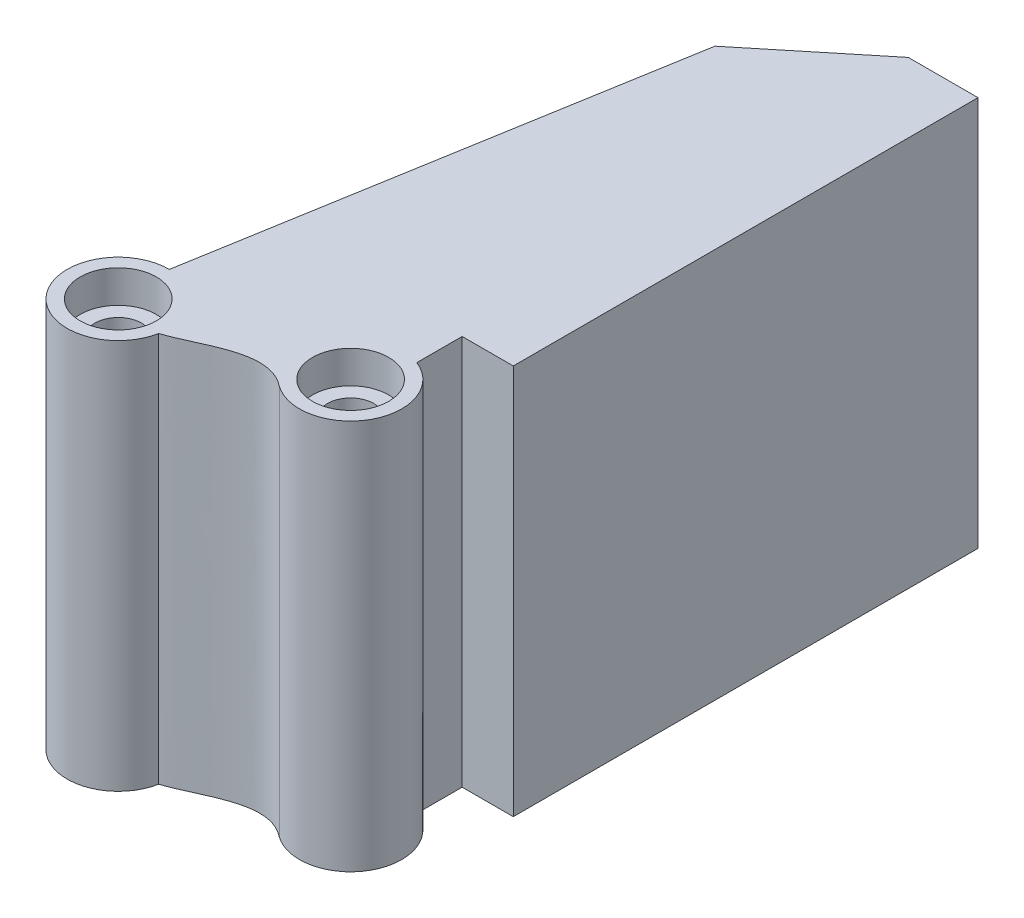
from build123d import *

# Parameters (mm, degrees)
SKETCH3_R           = 2.5
BOSS_EXTRUDE1_DEPTH = 21
SKETCH4_R           = 4.1
CUT_EXTRUDE1_DEPTH  = 3.5
CUT_EXTRUDE2_START  = -3.5
SKETCH5_R           = 4.1
CUT_EXTRUDE2_DEPTH  = 3.5


with BuildPart() as part:
    # Sketch3 → Boss-Extrude1 (new, symmetric)
    with BuildSketch(Plane(origin=(0, 0, 0), x_dir=(1, 0, 0), z_dir=(0, 1, 0))):
        with BuildLine():
            Line((0, 101.341600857), (0, 151.341600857))
            Line((0, 151.341600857), (-7.5, 151.341600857))
            Line((-7.5, 151.341600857), (-18.949604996, 141.985276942))
            Line((-18.949604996, 141.985276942), (-27.5, 91.841600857))
            ThreePointArc((-27.5, 91.841600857), (-31.745632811, 82.845231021), (-22.102071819, 85.286910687))
            add(Edge.make_bspline(
                [(-22.102071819, 85.286910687), (-18.703506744, 86.381702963), (-14.372621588, 89.778219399), (-10.713923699, 86.878340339)],
                knots=[0.019161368, 0.019161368, 0.019161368, 0.019161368, 1.019161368, 1.019161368, 1.019161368, 1.019161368], degree=3))
            ThreePointArc((-10.713923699, 86.878340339), (-2.668356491, 88.713822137), (-5.5, 96.46507624))
            Line((-5.5, 96.46507624), (-5.5, 101.341600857))
            Line((-5.5, 101.341600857), (0, 101.341600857))
        make_face()
        with Locations(Location((-27.5, 86.341600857, 0), (0, 0, 90))):
            Circle(SKETCH3_R, mode=Mode.SUBTRACT)
        with Locations(Location((-7.5, 91.341600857, 0), (0, 0, 90))):
            Circle(SKETCH3_R, mode=Mode.SUBTRACT)
    extrude(amount=BOSS_EXTRUDE1_DEPTH, both=True)

    # Sketch4 → Cut-Extrude1 (cut)
    with BuildSketch(Plane(origin=(0, 21, 0), x_dir=(1, 0, 0), z_dir=(0, 1, 0))):
        with Locations(Location((-27.5, 86.341600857, 0), (0, 0, 270))):
            Circle(SKETCH4_R)
        with Locations(Location((-7.5, 91.341600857, 0), (0, 0, 270))):
            Circle(SKETCH4_R)
    extrude(amount=-CUT_EXTRUDE1_DEPTH, mode=Mode.SUBTRACT)

    # Sketch5 → Cut-Extrude2 (cut)
    with BuildSketch(Plane.XZ.offset(21).offset(CUT_EXTRUDE2_START)):
        with Locations(Location((-27.5, -86.341600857, 0), (0, 0, 90))):
            Circle(SKETCH5_R)
        with Locations(Location((-7.5, -91.341600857, 0), (0, 0, 90))):
            Circle(SKETCH5_R)
    extrude(amount=CUT_EXTRUDE2_DEPTH, mode=Mode.SUBTRACT)


solid = part.part
